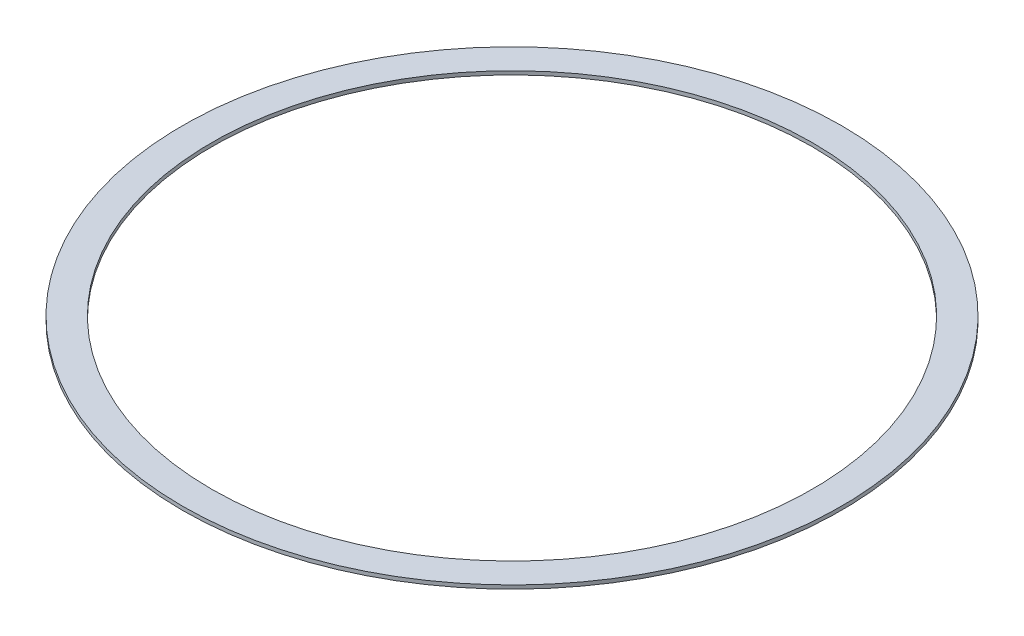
from build123d import *

# Parameters (mm, degrees)
SKETCH_1_R      = 45
SKETCH_1_R_2    = 41
EXTRUDE_1_DEPTH = 0.5


with BuildPart() as part:
    # Sketch 1 → Extrude 1 (new body)
    with BuildSketch(Plane(origin=(0, 0, 0), x_dir=(1, 0, 0), z_dir=(0, 1, 0))):
        with Locations(Location((0, 0, 0), (0, 0, 270))):
            Circle(SKETCH_1_R)
        with Locations(Location((0, 0, 0), (0, 0, 270))):
            Circle(SKETCH_1_R_2, mode=Mode.SUBTRACT)
    extrude(amount=EXTRUDE_1_DEPTH)


solid = part.part
